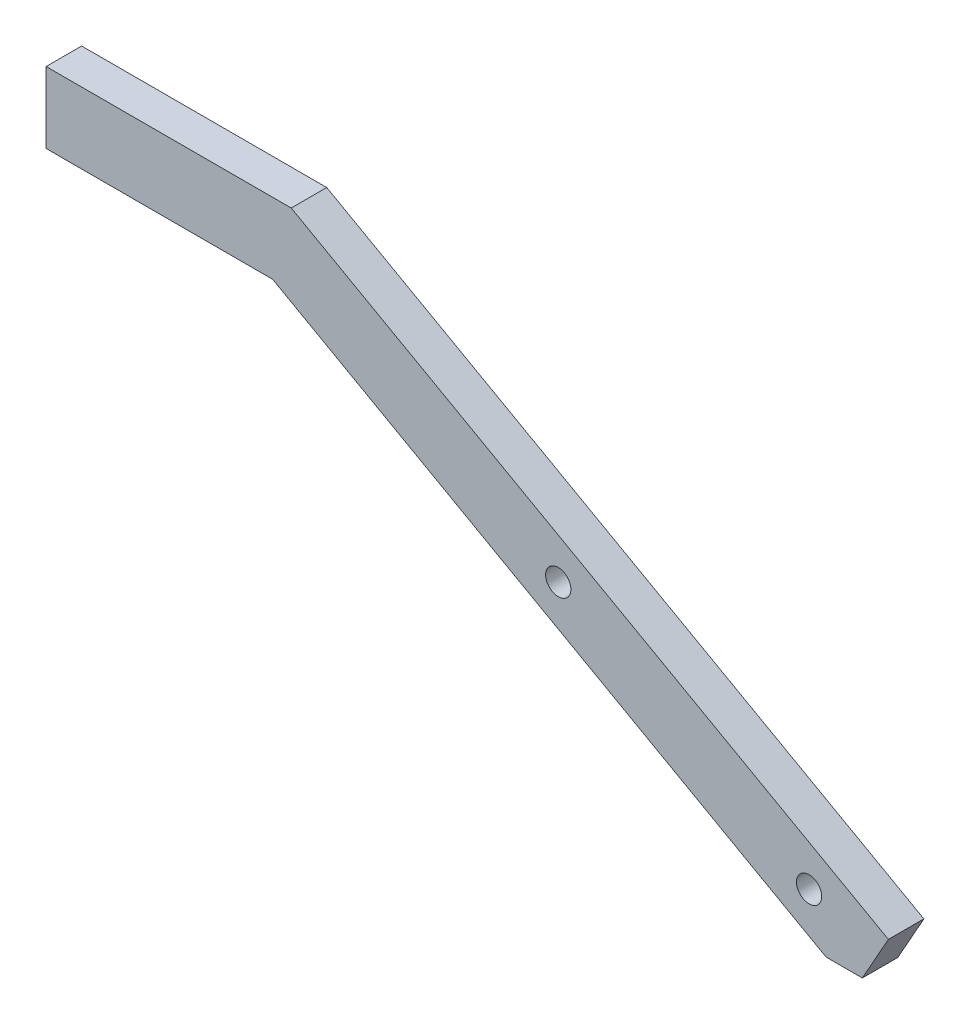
from build123d import *

# Parameters (mm, degrees)
EXTRUDE1_DEPTH        = 3.175
F_4_40_TAPPED_HOLE1_D = 2.2606


with BuildPart() as part:
    # Sketch1 → Extrude1 (new body)
    with BuildSketch(Plane.XY):
        Polygon((-12.908439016, -55.335987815), (-15.2375, -59.490128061), (-18.483644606, -59.490128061), (-67.961259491, -31.75), (-88.219574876, -31.75), (-88.219574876, -25.4), (-66.302614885, -25.4), align=None)
    extrude(amount=EXTRUDE1_DEPTH)

    # 4-40 Tapped Hole1 (through all)
    with Locations(Plane(origin=(0, 0, 0), x_dir=(-1, 0, 0), z_dir=(0, 0, -1))):
        with Locations((20, -55), (42.426406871, -42.426406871)):
            Hole(F_4_40_TAPPED_HOLE1_D / 2)


solid = part.part
